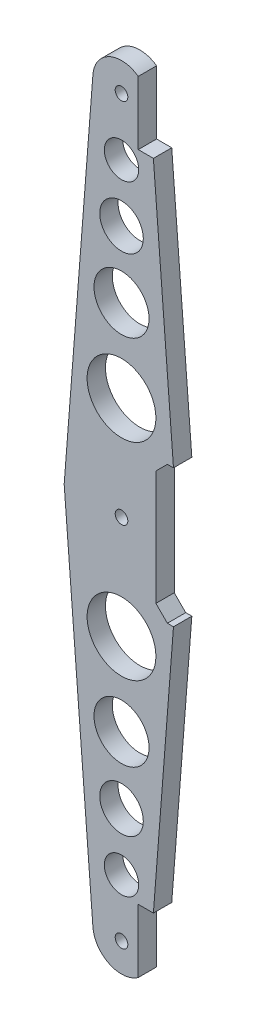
ISO-10303-21;
HEADER;
FILE_DESCRIPTION(('STEP AP214'),'2;1');
FILE_NAME('part.step','',(''),(''),'','','');
FILE_SCHEMA(('AUTOMOTIVE_DESIGN { 1 0 10303 214 1 1 1 1 }'));
ENDSEC;
DATA;
#1=APPLICATION_CONTEXT('core data for automotive mechanical design processes');
#2=APPLICATION_PROTOCOL_DEFINITION('international standard','automotive_design',2000,#1);
#3=PRODUCT_CONTEXT('',#1,'mechanical');
#4=PRODUCT('Part','Part','',(#3));
#5=PRODUCT_RELATED_PRODUCT_CATEGORY('part','',(#4));
#6=PRODUCT_DEFINITION_FORMATION('','',#4);
#7=PRODUCT_DEFINITION_CONTEXT('part definition',#1,'design');
#8=PRODUCT_DEFINITION('design','',#6,#7);
#9=PRODUCT_DEFINITION_SHAPE('','',#8);
#10=(LENGTH_UNIT() NAMED_UNIT(*) SI_UNIT(.MILLI.,.METRE.));
#11=(NAMED_UNIT(*) PLANE_ANGLE_UNIT() SI_UNIT($,.RADIAN.));
#12=(NAMED_UNIT(*) SI_UNIT($,.STERADIAN.) SOLID_ANGLE_UNIT());
#13=UNCERTAINTY_MEASURE_WITH_UNIT(LENGTH_MEASURE(1.E-05),#10,'distance_accuracy_value','');
#14=(GEOMETRIC_REPRESENTATION_CONTEXT(3) GLOBAL_UNCERTAINTY_ASSIGNED_CONTEXT((#13)) GLOBAL_UNIT_ASSIGNED_CONTEXT((#10,
#11,#12)) REPRESENTATION_CONTEXT('',''));
#15=CARTESIAN_POINT('',(0.,0.,0.));
#16=DIRECTION('',(0.,0.,1.));
#17=DIRECTION('',(1.,0.,0.));
#18=AXIS2_PLACEMENT_3D('',#15,#16,#17);
#19=CARTESIAN_POINT('',(0.,32.,1.6));
#20=DIRECTION('',(0.,0.,-1.));
#21=DIRECTION('',(-1.,0.,0.));
#22=AXIS2_PLACEMENT_3D('',#19,#20,#21);
#23=PLANE('',#22);
#24=CARTESIAN_POINT('',(0.,-32.,1.6));
#25=DIRECTION('',(0.,0.,-1.));
#26=DIRECTION('',(1.,0.,0.));
#27=AXIS2_PLACEMENT_3D('',#24,#25,#26);
#28=CIRCLE('',#27,0.550000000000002);
#29=CARTESIAN_POINT('',(0.550000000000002,-32.,1.6));
#30=VERTEX_POINT('',#29);
#31=EDGE_CURVE('E195',#30,#30,#28,.T.);
#32=ORIENTED_EDGE('',*,*,#31,.T.);
#33=EDGE_LOOP('',(#32));
#34=FACE_BOUND('',#33,.T.);
#35=CARTESIAN_POINT('',(0.,-22.,1.6));
#36=DIRECTION('',(0.,0.,-1.));
#37=DIRECTION('',(1.,0.,0.));
#38=AXIS2_PLACEMENT_3D('',#35,#36,#37);
#39=CIRCLE('',#38,1.9);
#40=CARTESIAN_POINT('',(1.9,-22.,1.6));
#41=VERTEX_POINT('',#40);
#42=EDGE_CURVE('E205',#41,#41,#39,.T.);
#43=ORIENTED_EDGE('',*,*,#42,.T.);
#44=EDGE_LOOP('',(#43));
#45=FACE_BOUND('',#44,.T.);
#46=CARTESIAN_POINT('',(0.,-9.00000000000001,1.6));
#47=DIRECTION('',(0.,0.,-1.));
#48=DIRECTION('',(1.,0.,0.));
#49=AXIS2_PLACEMENT_3D('',#46,#47,#48);
#50=CIRCLE('',#49,3.);
#51=CARTESIAN_POINT('',(3.,-9.00000000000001,1.6));
#52=VERTEX_POINT('',#51);
#53=EDGE_CURVE('E217',#52,#52,#50,.T.);
#54=ORIENTED_EDGE('',*,*,#53,.T.);
#55=EDGE_LOOP('',(#54));
#56=FACE_BOUND('',#55,.T.);
#57=CARTESIAN_POINT('',(0.,32.,1.6));
#58=DIRECTION('',(0.,0.,1.));
#59=DIRECTION('',(1.,0.,0.));
#60=AXIS2_PLACEMENT_3D('',#57,#58,#59);
#61=CIRCLE('',#60,0.550000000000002);
#62=CARTESIAN_POINT('',(0.550000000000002,32.,1.6));
#63=VERTEX_POINT('',#62);
#64=EDGE_CURVE('E241',#63,#63,#61,.T.);
#65=ORIENTED_EDGE('',*,*,#64,.F.);
#66=EDGE_LOOP('',(#65));
#67=FACE_BOUND('',#66,.T.);
#68=CARTESIAN_POINT('',(0.,27.,1.6));
#69=DIRECTION('',(0.,0.,1.));
#70=DIRECTION('',(1.,0.,0.));
#71=AXIS2_PLACEMENT_3D('',#68,#69,#70);
#72=CIRCLE('',#71,1.5);
#73=CARTESIAN_POINT('',(1.5,27.,1.6));
#74=VERTEX_POINT('',#73);
#75=EDGE_CURVE('E245',#74,#74,#72,.T.);
#76=ORIENTED_EDGE('',*,*,#75,.F.);
#77=EDGE_LOOP('',(#76));
#78=FACE_BOUND('',#77,.T.);
#79=CARTESIAN_POINT('',(0.,22.,1.6));
#80=DIRECTION('',(0.,0.,1.));
#81=DIRECTION('',(1.,0.,0.));
#82=AXIS2_PLACEMENT_3D('',#79,#80,#81);
#83=CIRCLE('',#82,1.9);
#84=CARTESIAN_POINT('',(1.9,22.,1.6));
#85=VERTEX_POINT('',#84);
#86=EDGE_CURVE('E251',#85,#85,#83,.T.);
#87=ORIENTED_EDGE('',*,*,#86,.F.);
#88=EDGE_LOOP('',(#87));
#89=FACE_BOUND('',#88,.T.);
#90=CARTESIAN_POINT('',(0.,16.2,1.6));
#91=DIRECTION('',(0.,0.,1.));
#92=DIRECTION('',(1.,0.,0.));
#93=AXIS2_PLACEMENT_3D('',#90,#91,#92);
#94=CIRCLE('',#93,2.4);
#95=CARTESIAN_POINT('',(2.4,16.2,1.6));
#96=VERTEX_POINT('',#95);
#97=EDGE_CURVE('E257',#96,#96,#94,.T.);
#98=ORIENTED_EDGE('',*,*,#97,.F.);
#99=EDGE_LOOP('',(#98));
#100=FACE_BOUND('',#99,.T.);
#101=CARTESIAN_POINT('',(0.,9.00000000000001,1.6));
#102=DIRECTION('',(0.,0.,1.));
#103=DIRECTION('',(1.,0.,0.));
#104=AXIS2_PLACEMENT_3D('',#101,#102,#103);
#105=CIRCLE('',#104,3.);
#106=CARTESIAN_POINT('',(3.,9.00000000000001,1.6));
#107=VERTEX_POINT('',#106);
#108=EDGE_CURVE('E263',#107,#107,#105,.T.);
#109=ORIENTED_EDGE('',*,*,#108,.F.);
#110=EDGE_LOOP('',(#109));
#111=FACE_BOUND('',#110,.T.);
#112=CARTESIAN_POINT('',(0.,0.,1.6));
#113=DIRECTION('',(0.,0.,1.));
#114=DIRECTION('',(1.,0.,0.));
#115=AXIS2_PLACEMENT_3D('',#112,#113,#114);
#116=CIRCLE('',#115,0.55);
#117=CARTESIAN_POINT('',(0.55,0.,1.6));
#118=VERTEX_POINT('',#117);
#119=EDGE_CURVE('E269',#118,#118,#116,.T.);
#120=ORIENTED_EDGE('',*,*,#119,.F.);
#121=EDGE_LOOP('',(#120));
#122=FACE_BOUND('',#121,.T.);
#123=CARTESIAN_POINT('',(0.,-16.2,1.6));
#124=DIRECTION('',(0.,0.,-1.));
#125=DIRECTION('',(1.,0.,0.));
#126=AXIS2_PLACEMENT_3D('',#123,#124,#125);
#127=CIRCLE('',#126,2.4);
#128=CARTESIAN_POINT('',(2.4,-16.2,1.6));
#129=VERTEX_POINT('',#128);
#130=EDGE_CURVE('E211',#129,#129,#127,.T.);
#131=ORIENTED_EDGE('',*,*,#130,.T.);
#132=EDGE_LOOP('',(#131));
#133=FACE_BOUND('',#132,.T.);
#134=CARTESIAN_POINT('',(0.,-27.,1.6));
#135=DIRECTION('',(0.,0.,-1.));
#136=DIRECTION('',(1.,0.,0.));
#137=AXIS2_PLACEMENT_3D('',#134,#135,#136);
#138=CIRCLE('',#137,1.5);
#139=CARTESIAN_POINT('',(1.5,-27.,1.6));
#140=VERTEX_POINT('',#139);
#141=EDGE_CURVE('E199',#140,#140,#138,.T.);
#142=ORIENTED_EDGE('',*,*,#141,.T.);
#143=EDGE_LOOP('',(#142));
#144=FACE_BOUND('',#143,.T.);
#145=DIRECTION('',(0.0776531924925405,0.996980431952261,0.));
#146=VECTOR('',#145,1.);
#147=CARTESIAN_POINT('',(2.49245107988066,-32.1941329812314,1.6));
#148=LINE('',#147,#146);
#149=CARTESIAN_POINT('',(2.78018111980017,-28.5,1.6));
#150=VERTEX_POINT('',#149);
#151=CARTESIAN_POINT('',(4.53266970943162,-6.,1.6));
#152=VERTEX_POINT('',#151);
#153=EDGE_CURVE('E278',#150,#152,#148,.T.);
#154=ORIENTED_EDGE('',*,*,#153,.T.);
#155=DIRECTION('',(1.,0.,0.));
#156=VECTOR('',#155,1.);
#157=CARTESIAN_POINT('',(9.99999999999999,-6.,1.6));
#158=LINE('',#157,#156);
#159=CARTESIAN_POINT('',(3.99999999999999,-6.,1.6));
#160=VERTEX_POINT('',#159);
#161=EDGE_CURVE('E162',#160,#152,#158,.T.);
#162=ORIENTED_EDGE('',*,*,#161,.F.);
#163=DIRECTION('',(0.707106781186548,-0.707106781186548,0.));
#164=VECTOR('',#163,1.);
#165=CARTESIAN_POINT('',(3.99999999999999,-6.,1.6));
#166=LINE('',#165,#164);
#167=CARTESIAN_POINT('',(2.99999999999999,-5.,1.6));
#168=VERTEX_POINT('',#167);
#169=EDGE_CURVE('E164',#168,#160,#166,.T.);
#170=ORIENTED_EDGE('',*,*,#169,.F.);
#171=DIRECTION('',(0.,-1.,0.));
#172=VECTOR('',#171,1.);
#173=CARTESIAN_POINT('',(2.99999999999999,5.,1.6));
#174=LINE('',#173,#172);
#175=CARTESIAN_POINT('',(2.99999999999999,5.,1.6));
#176=VERTEX_POINT('',#175);
#177=EDGE_CURVE('E175',#176,#168,#174,.T.);
#178=ORIENTED_EDGE('',*,*,#177,.F.);
#179=DIRECTION('',(-0.707106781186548,-0.707106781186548,0.));
#180=VECTOR('',#179,1.);
#181=CARTESIAN_POINT('',(3.99999999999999,6.,1.6));
#182=LINE('',#181,#180);
#183=CARTESIAN_POINT('',(3.99999999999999,6.,1.6));
#184=VERTEX_POINT('',#183);
#185=EDGE_CURVE('E173',#184,#176,#182,.T.);
#186=ORIENTED_EDGE('',*,*,#185,.F.);
#187=DIRECTION('',(-1.,0.,0.));
#188=VECTOR('',#187,1.);
#189=CARTESIAN_POINT('',(9.99999999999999,6.,1.6));
#190=LINE('',#189,#188);
#191=CARTESIAN_POINT('',(4.53266970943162,6.,1.6));
#192=VERTEX_POINT('',#191);
#193=EDGE_CURVE('E141',#192,#184,#190,.T.);
#194=ORIENTED_EDGE('',*,*,#193,.F.);
#195=DIRECTION('',(-0.0776531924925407,0.996980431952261,0.));
#196=VECTOR('',#195,1.);
#197=CARTESIAN_POINT('',(2.49245107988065,32.1941329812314,1.6));
#198=LINE('',#197,#196);
#199=CARTESIAN_POINT('',(2.78018111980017,28.5,1.6));
#200=VERTEX_POINT('',#199);
#201=EDGE_CURVE('E281',#192,#200,#198,.T.);
#202=ORIENTED_EDGE('',*,*,#201,.T.);
#203=DIRECTION('',(1.,0.,0.));
#204=VECTOR('',#203,1.);
#205=CARTESIAN_POINT('',(4.53962509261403,28.5,1.6));
#206=LINE('',#205,#204);
#207=CARTESIAN_POINT('',(1.46,28.5,1.6));
#208=VERTEX_POINT('',#207);
#209=EDGE_CURVE('E229',#208,#200,#206,.T.);
#210=ORIENTED_EDGE('',*,*,#209,.F.);
#211=DIRECTION('',(0.,-1.,0.));
#212=VECTOR('',#211,1.);
#213=CARTESIAN_POINT('',(1.46,34.5,1.6));
#214=LINE('',#213,#212);
#215=CARTESIAN_POINT('',(1.46,34.0293841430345,1.6));
#216=VERTEX_POINT('',#215);
#217=EDGE_CURVE('E223',#216,#208,#214,.T.);
#218=ORIENTED_EDGE('',*,*,#217,.F.);
#219=CARTESIAN_POINT('',(0.,32.,1.6));
#220=DIRECTION('',(0.,0.,1.));
#221=DIRECTION('',(-1.,0.,0.));
#222=AXIS2_PLACEMENT_3D('',#219,#220,#221);
#223=CIRCLE('',#222,2.5);
#224=CARTESIAN_POINT('',(-2.49245107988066,32.1941329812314,1.6));
#225=VERTEX_POINT('',#224);
#226=EDGE_CURVE('E284',#216,#225,#223,.T.);
#227=ORIENTED_EDGE('',*,*,#226,.T.);
#228=DIRECTION('',(-0.0776531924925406,-0.996980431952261,0.));
#229=VECTOR('',#228,1.);
#230=CARTESIAN_POINT('',(-5.,0.,1.6));
#231=LINE('',#230,#229);
#232=CARTESIAN_POINT('',(-5.,0.,1.6));
#233=VERTEX_POINT('',#232);
#234=EDGE_CURVE('E286',#225,#233,#231,.T.);
#235=ORIENTED_EDGE('',*,*,#234,.T.);
#236=DIRECTION('',(0.0776531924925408,-0.996980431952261,0.));
#237=VECTOR('',#236,1.);
#238=CARTESIAN_POINT('',(-5.,0.,1.6));
#239=LINE('',#238,#237);
#240=CARTESIAN_POINT('',(-2.49245107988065,-32.1941329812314,1.6));
#241=VERTEX_POINT('',#240);
#242=EDGE_CURVE('E288',#233,#241,#239,.T.);
#243=ORIENTED_EDGE('',*,*,#242,.T.);
#244=CARTESIAN_POINT('',(0.,-32.,1.6));
#245=DIRECTION('',(0.,0.,1.));
#246=DIRECTION('',(1.,0.,0.));
#247=AXIS2_PLACEMENT_3D('',#244,#245,#246);
#248=CIRCLE('',#247,2.5);
#249=CARTESIAN_POINT('',(1.46,-34.0293841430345,1.6));
#250=VERTEX_POINT('',#249);
#251=EDGE_CURVE('E290',#241,#250,#248,.T.);
#252=ORIENTED_EDGE('',*,*,#251,.T.);
#253=DIRECTION('',(0.,1.,0.));
#254=VECTOR('',#253,1.);
#255=CARTESIAN_POINT('',(1.46,-34.5,1.6));
#256=LINE('',#255,#254);
#257=CARTESIAN_POINT('',(1.46,-28.5,1.6));
#258=VERTEX_POINT('',#257);
#259=EDGE_CURVE('E55',#250,#258,#256,.T.);
#260=ORIENTED_EDGE('',*,*,#259,.T.);
#261=DIRECTION('',(1.,0.,0.));
#262=VECTOR('',#261,1.);
#263=CARTESIAN_POINT('',(4.53962509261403,-28.5,1.6));
#264=LINE('',#263,#262);
#265=EDGE_CURVE('E182',#258,#150,#264,.T.);
#266=ORIENTED_EDGE('',*,*,#265,.T.);
#267=EDGE_LOOP('',(#154,#162,#170,#178,#186,#194,#202,#210,#218,#227,#235,#243,#252,#260,#266));
#268=FACE_BOUND('',#267,.T.);
#269=ADVANCED_FACE('F32',(#34,#45,#56,#67,#78,#89,#100,#111,#122,#133,#144,#268),#23,.F.);
#270=CARTESIAN_POINT('',(0.,32.,0.));
#271=DIRECTION('',(0.,0.,-1.));
#272=DIRECTION('',(-1.,0.,0.));
#273=AXIS2_PLACEMENT_3D('',#270,#271,#272);
#274=PLANE('',#273);
#275=DIRECTION('',(1.,0.,0.));
#276=VECTOR('',#275,1.);
#277=CARTESIAN_POINT('',(9.99999999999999,-6.,0.));
#278=LINE('',#277,#276);
#279=CARTESIAN_POINT('',(3.99999999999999,-6.,0.));
#280=VERTEX_POINT('',#279);
#281=CARTESIAN_POINT('',(4.53266970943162,-6.,0.));
#282=VERTEX_POINT('',#281);
#283=EDGE_CURVE('E146',#280,#282,#278,.T.);
#284=ORIENTED_EDGE('',*,*,#283,.T.);
#285=DIRECTION('',(0.0776531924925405,0.996980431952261,0.));
#286=VECTOR('',#285,1.);
#287=CARTESIAN_POINT('',(2.49245107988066,-32.1941329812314,0.));
#288=LINE('',#287,#286);
#289=CARTESIAN_POINT('',(2.78018111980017,-28.5,0.));
#290=VERTEX_POINT('',#289);
#291=EDGE_CURVE('E275',#290,#282,#288,.T.);
#292=ORIENTED_EDGE('',*,*,#291,.F.);
#293=DIRECTION('',(1.,0.,0.));
#294=VECTOR('',#293,1.);
#295=CARTESIAN_POINT('',(4.53962509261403,-28.5,0.));
#296=LINE('',#295,#294);
#297=CARTESIAN_POINT('',(1.46,-28.5,0.));
#298=VERTEX_POINT('',#297);
#299=EDGE_CURVE('E186',#298,#290,#296,.T.);
#300=ORIENTED_EDGE('',*,*,#299,.F.);
#301=DIRECTION('',(0.,1.,0.));
#302=VECTOR('',#301,1.);
#303=CARTESIAN_POINT('',(1.46,-34.5,0.));
#304=LINE('',#303,#302);
#305=CARTESIAN_POINT('',(1.46,-34.0293841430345,0.));
#306=VERTEX_POINT('',#305);
#307=EDGE_CURVE('E188',#306,#298,#304,.T.);
#308=ORIENTED_EDGE('',*,*,#307,.F.);
#309=CARTESIAN_POINT('',(0.,-32.,0.));
#310=DIRECTION('',(0.,0.,1.));
#311=DIRECTION('',(1.,0.,0.));
#312=AXIS2_PLACEMENT_3D('',#309,#310,#311);
#313=CIRCLE('',#312,2.5);
#314=CARTESIAN_POINT('',(-2.49245107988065,-32.1941329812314,0.));
#315=VERTEX_POINT('',#314);
#316=EDGE_CURVE('E282',#315,#306,#313,.T.);
#317=ORIENTED_EDGE('',*,*,#316,.F.);
#318=DIRECTION('',(0.0776531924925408,-0.996980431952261,0.));
#319=VECTOR('',#318,1.);
#320=CARTESIAN_POINT('',(-5.,0.,0.));
#321=LINE('',#320,#319);
#322=CARTESIAN_POINT('',(-5.,0.,0.));
#323=VERTEX_POINT('',#322);
#324=EDGE_CURVE('E301',#323,#315,#321,.T.);
#325=ORIENTED_EDGE('',*,*,#324,.F.);
#326=DIRECTION('',(-0.0776531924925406,-0.996980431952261,0.));
#327=VECTOR('',#326,1.);
#328=CARTESIAN_POINT('',(-5.,0.,0.));
#329=LINE('',#328,#327);
#330=CARTESIAN_POINT('',(-2.49245107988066,32.1941329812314,0.));
#331=VERTEX_POINT('',#330);
#332=EDGE_CURVE('E299',#331,#323,#329,.T.);
#333=ORIENTED_EDGE('',*,*,#332,.F.);
#334=CARTESIAN_POINT('',(0.,32.,0.));
#335=DIRECTION('',(0.,0.,1.));
#336=DIRECTION('',(-1.,0.,0.));
#337=AXIS2_PLACEMENT_3D('',#334,#335,#336);
#338=CIRCLE('',#337,2.5);
#339=CARTESIAN_POINT('',(1.46,34.0293841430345,0.));
#340=VERTEX_POINT('',#339);
#341=EDGE_CURVE('E297',#340,#331,#338,.T.);
#342=ORIENTED_EDGE('',*,*,#341,.F.);
#343=DIRECTION('',(0.,1.,0.));
#344=VECTOR('',#343,1.);
#345=CARTESIAN_POINT('',(1.46,32.,0.));
#346=LINE('',#345,#344);
#347=CARTESIAN_POINT('',(1.46,28.5,0.));
#348=VERTEX_POINT('',#347);
#349=EDGE_CURVE('E313',#348,#340,#346,.T.);
#350=ORIENTED_EDGE('',*,*,#349,.F.);
#351=DIRECTION('',(1.,0.,0.));
#352=VECTOR('',#351,1.);
#353=CARTESIAN_POINT('',(4.53962509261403,28.5,0.));
#354=LINE('',#353,#352);
#355=CARTESIAN_POINT('',(2.78018111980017,28.5,0.));
#356=VERTEX_POINT('',#355);
#357=EDGE_CURVE('E226',#348,#356,#354,.T.);
#358=ORIENTED_EDGE('',*,*,#357,.T.);
#359=DIRECTION('',(-0.0776531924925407,0.996980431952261,0.));
#360=VECTOR('',#359,1.);
#361=CARTESIAN_POINT('',(2.49245107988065,32.1941329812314,0.));
#362=LINE('',#361,#360);
#363=CARTESIAN_POINT('',(4.53266970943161,6.00000000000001,0.));
#364=VERTEX_POINT('',#363);
#365=EDGE_CURVE('E161',#364,#356,#362,.T.);
#366=ORIENTED_EDGE('',*,*,#365,.F.);
#367=DIRECTION('',(-1.,0.,0.));
#368=VECTOR('',#367,1.);
#369=CARTESIAN_POINT('',(9.99999999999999,6.,0.));
#370=LINE('',#369,#368);
#371=CARTESIAN_POINT('',(3.99999999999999,6.,0.));
#372=VERTEX_POINT('',#371);
#373=EDGE_CURVE('E47',#364,#372,#370,.T.);
#374=ORIENTED_EDGE('',*,*,#373,.T.);
#375=DIRECTION('',(-0.707106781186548,-0.707106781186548,0.));
#376=VECTOR('',#375,1.);
#377=CARTESIAN_POINT('',(3.99999999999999,6.,0.));
#378=LINE('',#377,#376);
#379=CARTESIAN_POINT('',(2.99999999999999,5.,0.));
#380=VERTEX_POINT('',#379);
#381=EDGE_CURVE('E149',#372,#380,#378,.T.);
#382=ORIENTED_EDGE('',*,*,#381,.T.);
#383=DIRECTION('',(0.,-1.,0.));
#384=VECTOR('',#383,1.);
#385=CARTESIAN_POINT('',(2.99999999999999,5.,0.));
#386=LINE('',#385,#384);
#387=CARTESIAN_POINT('',(2.99999999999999,-5.,0.));
#388=VERTEX_POINT('',#387);
#389=EDGE_CURVE('E154',#380,#388,#386,.T.);
#390=ORIENTED_EDGE('',*,*,#389,.T.);
#391=DIRECTION('',(0.707106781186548,-0.707106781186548,0.));
#392=VECTOR('',#391,1.);
#393=CARTESIAN_POINT('',(3.99999999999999,-6.,0.));
#394=LINE('',#393,#392);
#395=EDGE_CURVE('E168',#388,#280,#394,.T.);
#396=ORIENTED_EDGE('',*,*,#395,.T.);
#397=EDGE_LOOP('',(#284,#292,#300,#308,#317,#325,#333,#342,#350,#358,#366,#374,#382,#390,#396));
#398=FACE_BOUND('',#397,.T.);
#399=CARTESIAN_POINT('',(0.,-32.,0.));
#400=DIRECTION('',(0.,0.,-1.));
#401=DIRECTION('',(1.,0.,0.));
#402=AXIS2_PLACEMENT_3D('',#399,#400,#401);
#403=CIRCLE('',#402,0.550000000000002);
#404=CARTESIAN_POINT('',(0.550000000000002,-32.,0.));
#405=VERTEX_POINT('',#404);
#406=EDGE_CURVE('E196',#405,#405,#403,.T.);
#407=ORIENTED_EDGE('',*,*,#406,.F.);
#408=EDGE_LOOP('',(#407));
#409=FACE_BOUND('',#408,.T.);
#410=CARTESIAN_POINT('',(0.,-22.,0.));
#411=DIRECTION('',(0.,0.,-1.));
#412=DIRECTION('',(1.,0.,0.));
#413=AXIS2_PLACEMENT_3D('',#410,#411,#412);
#414=CIRCLE('',#413,1.9);
#415=CARTESIAN_POINT('',(1.9,-22.,0.));
#416=VERTEX_POINT('',#415);
#417=EDGE_CURVE('E208',#416,#416,#414,.T.);
#418=ORIENTED_EDGE('',*,*,#417,.F.);
#419=EDGE_LOOP('',(#418));
#420=FACE_BOUND('',#419,.T.);
#421=CARTESIAN_POINT('',(0.,-9.00000000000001,0.));
#422=DIRECTION('',(0.,0.,-1.));
#423=DIRECTION('',(1.,0.,0.));
#424=AXIS2_PLACEMENT_3D('',#421,#422,#423);
#425=CIRCLE('',#424,3.);
#426=CARTESIAN_POINT('',(3.,-9.00000000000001,0.));
#427=VERTEX_POINT('',#426);
#428=EDGE_CURVE('E220',#427,#427,#425,.T.);
#429=ORIENTED_EDGE('',*,*,#428,.F.);
#430=EDGE_LOOP('',(#429));
#431=FACE_BOUND('',#430,.T.);
#432=CARTESIAN_POINT('',(0.,32.,0.));
#433=DIRECTION('',(0.,0.,1.));
#434=DIRECTION('',(1.,0.,0.));
#435=AXIS2_PLACEMENT_3D('',#432,#433,#434);
#436=CIRCLE('',#435,0.550000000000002);
#437=CARTESIAN_POINT('',(0.550000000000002,32.,0.));
#438=VERTEX_POINT('',#437);
#439=EDGE_CURVE('E242',#438,#438,#436,.T.);
#440=ORIENTED_EDGE('',*,*,#439,.T.);
#441=EDGE_LOOP('',(#440));
#442=FACE_BOUND('',#441,.T.);
#443=CARTESIAN_POINT('',(0.,27.,0.));
#444=DIRECTION('',(0.,0.,1.));
#445=DIRECTION('',(1.,0.,0.));
#446=AXIS2_PLACEMENT_3D('',#443,#444,#445);
#447=CIRCLE('',#446,1.5);
#448=CARTESIAN_POINT('',(1.5,27.,0.));
#449=VERTEX_POINT('',#448);
#450=EDGE_CURVE('E248',#449,#449,#447,.T.);
#451=ORIENTED_EDGE('',*,*,#450,.T.);
#452=EDGE_LOOP('',(#451));
#453=FACE_BOUND('',#452,.T.);
#454=CARTESIAN_POINT('',(0.,22.,0.));
#455=DIRECTION('',(0.,0.,1.));
#456=DIRECTION('',(1.,0.,0.));
#457=AXIS2_PLACEMENT_3D('',#454,#455,#456);
#458=CIRCLE('',#457,1.9);
#459=CARTESIAN_POINT('',(1.9,22.,0.));
#460=VERTEX_POINT('',#459);
#461=EDGE_CURVE('E254',#460,#460,#458,.T.);
#462=ORIENTED_EDGE('',*,*,#461,.T.);
#463=EDGE_LOOP('',(#462));
#464=FACE_BOUND('',#463,.T.);
#465=CARTESIAN_POINT('',(0.,16.2,0.));
#466=DIRECTION('',(0.,0.,1.));
#467=DIRECTION('',(1.,0.,0.));
#468=AXIS2_PLACEMENT_3D('',#465,#466,#467);
#469=CIRCLE('',#468,2.4);
#470=CARTESIAN_POINT('',(2.4,16.2,0.));
#471=VERTEX_POINT('',#470);
#472=EDGE_CURVE('E260',#471,#471,#469,.T.);
#473=ORIENTED_EDGE('',*,*,#472,.T.);
#474=EDGE_LOOP('',(#473));
#475=FACE_BOUND('',#474,.T.);
#476=CARTESIAN_POINT('',(0.,9.00000000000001,0.));
#477=DIRECTION('',(0.,0.,1.));
#478=DIRECTION('',(1.,0.,0.));
#479=AXIS2_PLACEMENT_3D('',#476,#477,#478);
#480=CIRCLE('',#479,3.);
#481=CARTESIAN_POINT('',(3.,9.00000000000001,0.));
#482=VERTEX_POINT('',#481);
#483=EDGE_CURVE('E266',#482,#482,#480,.T.);
#484=ORIENTED_EDGE('',*,*,#483,.T.);
#485=EDGE_LOOP('',(#484));
#486=FACE_BOUND('',#485,.T.);
#487=CARTESIAN_POINT('',(0.,0.,0.));
#488=DIRECTION('',(0.,0.,1.));
#489=DIRECTION('',(1.,0.,0.));
#490=AXIS2_PLACEMENT_3D('',#487,#488,#489);
#491=CIRCLE('',#490,0.55);
#492=CARTESIAN_POINT('',(0.55,0.,0.));
#493=VERTEX_POINT('',#492);
#494=EDGE_CURVE('E272',#493,#493,#491,.T.);
#495=ORIENTED_EDGE('',*,*,#494,.T.);
#496=EDGE_LOOP('',(#495));
#497=FACE_BOUND('',#496,.T.);
#498=CARTESIAN_POINT('',(0.,-16.2,0.));
#499=DIRECTION('',(0.,0.,-1.));
#500=DIRECTION('',(1.,0.,0.));
#501=AXIS2_PLACEMENT_3D('',#498,#499,#500);
#502=CIRCLE('',#501,2.4);
#503=CARTESIAN_POINT('',(2.4,-16.2,0.));
#504=VERTEX_POINT('',#503);
#505=EDGE_CURVE('E214',#504,#504,#502,.T.);
#506=ORIENTED_EDGE('',*,*,#505,.F.);
#507=EDGE_LOOP('',(#506));
#508=FACE_BOUND('',#507,.T.);
#509=CARTESIAN_POINT('',(0.,-27.,0.));
#510=DIRECTION('',(0.,0.,-1.));
#511=DIRECTION('',(1.,0.,0.));
#512=AXIS2_PLACEMENT_3D('',#509,#510,#511);
#513=CIRCLE('',#512,1.5);
#514=CARTESIAN_POINT('',(1.5,-27.,0.));
#515=VERTEX_POINT('',#514);
#516=EDGE_CURVE('E202',#515,#515,#513,.T.);
#517=ORIENTED_EDGE('',*,*,#516,.F.);
#518=EDGE_LOOP('',(#517));
#519=FACE_BOUND('',#518,.T.);
#520=ADVANCED_FACE('F158',(#398,#409,#420,#431,#442,#453,#464,#475,#486,#497,#508,#519),#274,.T.);
#521=CARTESIAN_POINT('',(2.49245107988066,-32.1941329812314,1.6));
#522=DIRECTION('',(-0.996980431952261,0.0776531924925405,0.));
#523=DIRECTION('',(-0.0776531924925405,-0.996980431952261,0.));
#524=AXIS2_PLACEMENT_3D('',#521,#522,#523);
#525=PLANE('',#524);
#526=ORIENTED_EDGE('',*,*,#291,.T.);
#527=DIRECTION('',(0.,0.,1.));
#528=VECTOR('',#527,1.);
#529=CARTESIAN_POINT('',(4.53266970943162,-6.,1.6));
#530=LINE('',#529,#528);
#531=EDGE_CURVE('E11',#282,#152,#530,.T.);
#532=ORIENTED_EDGE('',*,*,#531,.T.);
#533=ORIENTED_EDGE('',*,*,#153,.F.);
#534=DIRECTION('',(0.,0.,1.));
#535=VECTOR('',#534,1.);
#536=CARTESIAN_POINT('',(2.78018111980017,-28.5,1.6));
#537=LINE('',#536,#535);
#538=EDGE_CURVE('E317',#290,#150,#537,.T.);
#539=ORIENTED_EDGE('',*,*,#538,.F.);
#540=EDGE_LOOP('',(#526,#532,#533,#539));
#541=FACE_BOUND('',#540,.T.);
#542=ADVANCED_FACE('F34',(#541),#525,.F.);
#543=CARTESIAN_POINT('',(0.,-32.,1.6));
#544=DIRECTION('',(0.,0.,-1.));
#545=DIRECTION('',(-1.,0.,0.));
#546=AXIS2_PLACEMENT_3D('',#543,#544,#545);
#547=CYLINDRICAL_SURFACE('',#546,2.5);
#548=DIRECTION('',(0.,0.,-1.));
#549=VECTOR('',#548,1.);
#550=CARTESIAN_POINT('',(1.46,-34.0293841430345,1.6));
#551=LINE('',#550,#549);
#552=EDGE_CURVE('E315',#250,#306,#551,.T.);
#553=ORIENTED_EDGE('',*,*,#552,.F.);
#554=ORIENTED_EDGE('',*,*,#251,.F.);
#555=DIRECTION('',(0.,0.,-1.));
#556=VECTOR('',#555,1.);
#557=CARTESIAN_POINT('',(-2.49245107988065,-32.1941329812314,1.6));
#558=LINE('',#557,#556);
#559=EDGE_CURVE('E293',#241,#315,#558,.T.);
#560=ORIENTED_EDGE('',*,*,#559,.T.);
#561=ORIENTED_EDGE('',*,*,#316,.T.);
#562=EDGE_LOOP('',(#553,#554,#560,#561));
#563=FACE_BOUND('',#562,.T.);
#564=ADVANCED_FACE('F348',(#563),#547,.T.);
#565=CARTESIAN_POINT('',(2.49245107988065,32.1941329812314,1.6));
#566=DIRECTION('',(-0.996980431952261,-0.0776531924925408,0.));
#567=DIRECTION('',(0.0776531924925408,-0.996980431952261,0.));
#568=AXIS2_PLACEMENT_3D('',#565,#566,#567);
#569=PLANE('',#568);
#570=ORIENTED_EDGE('',*,*,#201,.F.);
#571=DIRECTION('',(0.,0.,-1.));
#572=VECTOR('',#571,1.);
#573=CARTESIAN_POINT('',(4.53266970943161,6.,1.6));
#574=LINE('',#573,#572);
#575=EDGE_CURVE('E40',#192,#364,#574,.T.);
#576=ORIENTED_EDGE('',*,*,#575,.T.);
#577=ORIENTED_EDGE('',*,*,#365,.T.);
#578=DIRECTION('',(0.,0.,1.));
#579=VECTOR('',#578,1.);
#580=CARTESIAN_POINT('',(2.78018111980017,28.5,1.6));
#581=LINE('',#580,#579);
#582=EDGE_CURVE('E238',#356,#200,#581,.T.);
#583=ORIENTED_EDGE('',*,*,#582,.T.);
#584=EDGE_LOOP('',(#570,#576,#577,#583));
#585=FACE_BOUND('',#584,.T.);
#586=ADVANCED_FACE('F320',(#585),#569,.F.);
#587=CARTESIAN_POINT('',(0.,32.,1.6));
#588=DIRECTION('',(0.,0.,-1.));
#589=DIRECTION('',(-1.,0.,0.));
#590=AXIS2_PLACEMENT_3D('',#587,#588,#589);
#591=CYLINDRICAL_SURFACE('',#590,2.5);
#592=ORIENTED_EDGE('',*,*,#226,.F.);
#593=DIRECTION('',(0.,0.,-1.));
#594=VECTOR('',#593,1.);
#595=CARTESIAN_POINT('',(1.46,34.0293841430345,1.6));
#596=LINE('',#595,#594);
#597=EDGE_CURVE('E235',#216,#340,#596,.T.);
#598=ORIENTED_EDGE('',*,*,#597,.T.);
#599=ORIENTED_EDGE('',*,*,#341,.T.);
#600=DIRECTION('',(0.,0.,-1.));
#601=VECTOR('',#600,1.);
#602=CARTESIAN_POINT('',(-2.49245107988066,32.1941329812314,1.6));
#603=LINE('',#602,#601);
#604=EDGE_CURVE('E310',#225,#331,#603,.T.);
#605=ORIENTED_EDGE('',*,*,#604,.F.);
#606=EDGE_LOOP('',(#592,#598,#599,#605));
#607=FACE_BOUND('',#606,.T.);
#608=ADVANCED_FACE('F364',(#607),#591,.T.);
#609=CARTESIAN_POINT('',(-5.,0.,1.6));
#610=DIRECTION('',(0.996980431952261,-0.0776531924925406,0.));
#611=DIRECTION('',(0.0776531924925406,0.996980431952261,0.));
#612=AXIS2_PLACEMENT_3D('',#609,#610,#611);
#613=PLANE('',#612);
#614=ORIENTED_EDGE('',*,*,#332,.T.);
#615=DIRECTION('',(0.,0.,-1.));
#616=VECTOR('',#615,1.);
#617=CARTESIAN_POINT('',(-5.,0.,1.6));
#618=LINE('',#617,#616);
#619=EDGE_CURVE('E307',#233,#323,#618,.T.);
#620=ORIENTED_EDGE('',*,*,#619,.F.);
#621=ORIENTED_EDGE('',*,*,#234,.F.);
#622=ORIENTED_EDGE('',*,*,#604,.T.);
#623=EDGE_LOOP('',(#614,#620,#621,#622));
#624=FACE_BOUND('',#623,.T.);
#625=ADVANCED_FACE('F359',(#624),#613,.F.);
#626=CARTESIAN_POINT('',(-5.,0.,1.6));
#627=DIRECTION('',(0.996980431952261,0.0776531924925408,0.));
#628=DIRECTION('',(-0.0776531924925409,0.996980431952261,0.));
#629=AXIS2_PLACEMENT_3D('',#626,#627,#628);
#630=PLANE('',#629);
#631=ORIENTED_EDGE('',*,*,#324,.T.);
#632=ORIENTED_EDGE('',*,*,#559,.F.);
#633=ORIENTED_EDGE('',*,*,#242,.F.);
#634=ORIENTED_EDGE('',*,*,#619,.T.);
#635=EDGE_LOOP('',(#631,#632,#633,#634));
#636=FACE_BOUND('',#635,.T.);
#637=ADVANCED_FACE('F353',(#636),#630,.F.);
#638=CARTESIAN_POINT('',(0.,0.,0.));
#639=DIRECTION('',(0.,0.,1.));
#640=DIRECTION('',(1.,0.,0.));
#641=AXIS2_PLACEMENT_3D('',#638,#639,#640);
#642=CYLINDRICAL_SURFACE('',#641,0.55);
#643=ORIENTED_EDGE('',*,*,#494,.F.);
#644=EDGE_LOOP('',(#643));
#645=FACE_BOUND('',#644,.T.);
#646=ORIENTED_EDGE('',*,*,#119,.T.);
#647=EDGE_LOOP('',(#646));
#648=FACE_BOUND('',#647,.T.);
#649=ADVANCED_FACE('F393',(#645,#648),#642,.F.);
#650=CARTESIAN_POINT('',(0.,9.00000000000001,0.));
#651=DIRECTION('',(0.,0.,1.));
#652=DIRECTION('',(1.,0.,0.));
#653=AXIS2_PLACEMENT_3D('',#650,#651,#652);
#654=CYLINDRICAL_SURFACE('',#653,3.);
#655=ORIENTED_EDGE('',*,*,#483,.F.);
#656=EDGE_LOOP('',(#655));
#657=FACE_BOUND('',#656,.T.);
#658=ORIENTED_EDGE('',*,*,#108,.T.);
#659=EDGE_LOOP('',(#658));
#660=FACE_BOUND('',#659,.T.);
#661=ADVANCED_FACE('F430',(#657,#660),#654,.F.);
#662=CARTESIAN_POINT('',(0.,16.2,0.));
#663=DIRECTION('',(0.,0.,1.));
#664=DIRECTION('',(1.,0.,0.));
#665=AXIS2_PLACEMENT_3D('',#662,#663,#664);
#666=CYLINDRICAL_SURFACE('',#665,2.4);
#667=ORIENTED_EDGE('',*,*,#472,.F.);
#668=EDGE_LOOP('',(#667));
#669=FACE_BOUND('',#668,.T.);
#670=ORIENTED_EDGE('',*,*,#97,.T.);
#671=EDGE_LOOP('',(#670));
#672=FACE_BOUND('',#671,.T.);
#673=ADVANCED_FACE('F437',(#669,#672),#666,.F.);
#674=CARTESIAN_POINT('',(0.,22.,0.));
#675=DIRECTION('',(0.,0.,1.));
#676=DIRECTION('',(1.,0.,0.));
#677=AXIS2_PLACEMENT_3D('',#674,#675,#676);
#678=CYLINDRICAL_SURFACE('',#677,1.9);
#679=ORIENTED_EDGE('',*,*,#461,.F.);
#680=EDGE_LOOP('',(#679));
#681=FACE_BOUND('',#680,.T.);
#682=ORIENTED_EDGE('',*,*,#86,.T.);
#683=EDGE_LOOP('',(#682));
#684=FACE_BOUND('',#683,.T.);
#685=ADVANCED_FACE('F444',(#681,#684),#678,.F.);
#686=CARTESIAN_POINT('',(0.,27.,0.));
#687=DIRECTION('',(0.,0.,1.));
#688=DIRECTION('',(1.,0.,0.));
#689=AXIS2_PLACEMENT_3D('',#686,#687,#688);
#690=CYLINDRICAL_SURFACE('',#689,1.5);
#691=ORIENTED_EDGE('',*,*,#450,.F.);
#692=EDGE_LOOP('',(#691));
#693=FACE_BOUND('',#692,.T.);
#694=ORIENTED_EDGE('',*,*,#75,.T.);
#695=EDGE_LOOP('',(#694));
#696=FACE_BOUND('',#695,.T.);
#697=ADVANCED_FACE('F380',(#693,#696),#690,.F.);
#698=CARTESIAN_POINT('',(0.,32.,0.));
#699=DIRECTION('',(0.,0.,1.));
#700=DIRECTION('',(1.,0.,0.));
#701=AXIS2_PLACEMENT_3D('',#698,#699,#700);
#702=CYLINDRICAL_SURFACE('',#701,0.550000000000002);
#703=ORIENTED_EDGE('',*,*,#439,.F.);
#704=EDGE_LOOP('',(#703));
#705=FACE_BOUND('',#704,.T.);
#706=ORIENTED_EDGE('',*,*,#64,.T.);
#707=EDGE_LOOP('',(#706));
#708=FACE_BOUND('',#707,.T.);
#709=ADVANCED_FACE('F372',(#705,#708),#702,.F.);
#710=CARTESIAN_POINT('',(4.53962509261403,28.5,0.));
#711=DIRECTION('',(0.,-1.,0.));
#712=DIRECTION('',(0.,0.,-1.));
#713=AXIS2_PLACEMENT_3D('',#710,#711,#712);
#714=PLANE('',#713);
#715=ORIENTED_EDGE('',*,*,#357,.F.);
#716=DIRECTION('',(0.,0.,1.));
#717=VECTOR('',#716,1.);
#718=CARTESIAN_POINT('',(1.46,28.5,0.));
#719=LINE('',#718,#717);
#720=EDGE_CURVE('E228',#348,#208,#719,.T.);
#721=ORIENTED_EDGE('',*,*,#720,.T.);
#722=ORIENTED_EDGE('',*,*,#209,.T.);
#723=ORIENTED_EDGE('',*,*,#582,.F.);
#724=EDGE_LOOP('',(#715,#721,#722,#723));
#725=FACE_BOUND('',#724,.T.);
#726=ADVANCED_FACE('F370',(#725),#714,.F.);
#727=CARTESIAN_POINT('',(1.46,34.5,0.));
#728=DIRECTION('',(-1.,0.,0.));
#729=DIRECTION('',(0.,-1.,0.));
#730=AXIS2_PLACEMENT_3D('',#727,#728,#729);
#731=PLANE('',#730);
#732=ORIENTED_EDGE('',*,*,#217,.T.);
#733=ORIENTED_EDGE('',*,*,#720,.F.);
#734=ORIENTED_EDGE('',*,*,#349,.T.);
#735=ORIENTED_EDGE('',*,*,#597,.F.);
#736=EDGE_LOOP('',(#732,#733,#734,#735));
#737=FACE_BOUND('',#736,.T.);
#738=ADVANCED_FACE('F367',(#737),#731,.F.);
#739=CARTESIAN_POINT('',(0.,-9.00000000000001,0.));
#740=DIRECTION('',(0.,0.,1.));
#741=DIRECTION('',(1.,0.,0.));
#742=AXIS2_PLACEMENT_3D('',#739,#740,#741);
#743=CYLINDRICAL_SURFACE('',#742,3.);
#744=ORIENTED_EDGE('',*,*,#428,.T.);
#745=EDGE_LOOP('',(#744));
#746=FACE_BOUND('',#745,.T.);
#747=ORIENTED_EDGE('',*,*,#53,.F.);
#748=EDGE_LOOP('',(#747));
#749=FACE_BOUND('',#748,.T.);
#750=ADVANCED_FACE('F378',(#746,#749),#743,.F.);
#751=CARTESIAN_POINT('',(0.,-16.2,0.));
#752=DIRECTION('',(0.,0.,1.));
#753=DIRECTION('',(1.,0.,0.));
#754=AXIS2_PLACEMENT_3D('',#751,#752,#753);
#755=CYLINDRICAL_SURFACE('',#754,2.4);
#756=ORIENTED_EDGE('',*,*,#505,.T.);
#757=EDGE_LOOP('',(#756));
#758=FACE_BOUND('',#757,.T.);
#759=ORIENTED_EDGE('',*,*,#130,.F.);
#760=EDGE_LOOP('',(#759));
#761=FACE_BOUND('',#760,.T.);
#762=ADVANCED_FACE('F484',(#758,#761),#755,.F.);
#763=CARTESIAN_POINT('',(0.,-22.,0.));
#764=DIRECTION('',(0.,0.,1.));
#765=DIRECTION('',(1.,0.,0.));
#766=AXIS2_PLACEMENT_3D('',#763,#764,#765);
#767=CYLINDRICAL_SURFACE('',#766,1.9);
#768=ORIENTED_EDGE('',*,*,#417,.T.);
#769=EDGE_LOOP('',(#768));
#770=FACE_BOUND('',#769,.T.);
#771=ORIENTED_EDGE('',*,*,#42,.F.);
#772=EDGE_LOOP('',(#771));
#773=FACE_BOUND('',#772,.T.);
#774=ADVANCED_FACE('F492',(#770,#773),#767,.F.);
#775=CARTESIAN_POINT('',(0.,-27.,0.));
#776=DIRECTION('',(0.,0.,1.));
#777=DIRECTION('',(1.,0.,0.));
#778=AXIS2_PLACEMENT_3D('',#775,#776,#777);
#779=CYLINDRICAL_SURFACE('',#778,1.5);
#780=ORIENTED_EDGE('',*,*,#516,.T.);
#781=EDGE_LOOP('',(#780));
#782=FACE_BOUND('',#781,.T.);
#783=ORIENTED_EDGE('',*,*,#141,.F.);
#784=EDGE_LOOP('',(#783));
#785=FACE_BOUND('',#784,.T.);
#786=ADVANCED_FACE('F501',(#782,#785),#779,.F.);
#787=CARTESIAN_POINT('',(0.,-32.,0.));
#788=DIRECTION('',(0.,0.,1.));
#789=DIRECTION('',(1.,0.,0.));
#790=AXIS2_PLACEMENT_3D('',#787,#788,#789);
#791=CYLINDRICAL_SURFACE('',#790,0.550000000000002);
#792=ORIENTED_EDGE('',*,*,#406,.T.);
#793=EDGE_LOOP('',(#792));
#794=FACE_BOUND('',#793,.T.);
#795=ORIENTED_EDGE('',*,*,#31,.F.);
#796=EDGE_LOOP('',(#795));
#797=FACE_BOUND('',#796,.T.);
#798=ADVANCED_FACE('F510',(#794,#797),#791,.F.);
#799=CARTESIAN_POINT('',(4.53962509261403,-28.5,0.));
#800=DIRECTION('',(0.,-1.,0.));
#801=DIRECTION('',(0.,0.,-1.));
#802=AXIS2_PLACEMENT_3D('',#799,#800,#801);
#803=PLANE('',#802);
#804=ORIENTED_EDGE('',*,*,#538,.T.);
#805=ORIENTED_EDGE('',*,*,#265,.F.);
#806=DIRECTION('',(0.,0.,1.));
#807=VECTOR('',#806,1.);
#808=CARTESIAN_POINT('',(1.46,-28.5,0.));
#809=LINE('',#808,#807);
#810=EDGE_CURVE('E190',#298,#258,#809,.T.);
#811=ORIENTED_EDGE('',*,*,#810,.F.);
#812=ORIENTED_EDGE('',*,*,#299,.T.);
#813=EDGE_LOOP('',(#804,#805,#811,#812));
#814=FACE_BOUND('',#813,.T.);
#815=ADVANCED_FACE('F342',(#814),#803,.T.);
#816=CARTESIAN_POINT('',(1.46,-34.5,0.));
#817=DIRECTION('',(1.,0.,0.));
#818=DIRECTION('',(0.,1.,0.));
#819=AXIS2_PLACEMENT_3D('',#816,#817,#818);
#820=PLANE('',#819);
#821=ORIENTED_EDGE('',*,*,#552,.T.);
#822=ORIENTED_EDGE('',*,*,#307,.T.);
#823=ORIENTED_EDGE('',*,*,#810,.T.);
#824=ORIENTED_EDGE('',*,*,#259,.F.);
#825=EDGE_LOOP('',(#821,#822,#823,#824));
#826=FACE_BOUND('',#825,.T.);
#827=ADVANCED_FACE('F545',(#826),#820,.T.);
#828=CARTESIAN_POINT('',(9.99999999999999,-6.,0.));
#829=DIRECTION('',(0.,-1.,0.));
#830=DIRECTION('',(1.,0.,0.));
#831=AXIS2_PLACEMENT_3D('',#828,#829,#830);
#832=PLANE('',#831);
#833=ORIENTED_EDGE('',*,*,#283,.F.);
#834=DIRECTION('',(0.,0.,1.));
#835=VECTOR('',#834,1.);
#836=CARTESIAN_POINT('',(3.99999999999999,-6.,0.));
#837=LINE('',#836,#835);
#838=EDGE_CURVE('E180',#280,#160,#837,.T.);
#839=ORIENTED_EDGE('',*,*,#838,.T.);
#840=ORIENTED_EDGE('',*,*,#161,.T.);
#841=ORIENTED_EDGE('',*,*,#531,.F.);
#842=EDGE_LOOP('',(#833,#839,#840,#841));
#843=FACE_BOUND('',#842,.T.);
#844=ADVANCED_FACE('F335',(#843),#832,.F.);
#845=CARTESIAN_POINT('',(9.99999999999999,6.,0.));
#846=DIRECTION('',(0.,1.,0.));
#847=DIRECTION('',(-1.,0.,0.));
#848=AXIS2_PLACEMENT_3D('',#845,#846,#847);
#849=PLANE('',#848);
#850=ORIENTED_EDGE('',*,*,#193,.T.);
#851=DIRECTION('',(0.,0.,1.));
#852=VECTOR('',#851,1.);
#853=CARTESIAN_POINT('',(3.99999999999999,6.,0.));
#854=LINE('',#853,#852);
#855=EDGE_CURVE('E137',#372,#184,#854,.T.);
#856=ORIENTED_EDGE('',*,*,#855,.F.);
#857=ORIENTED_EDGE('',*,*,#373,.F.);
#858=ORIENTED_EDGE('',*,*,#575,.F.);
#859=EDGE_LOOP('',(#850,#856,#857,#858));
#860=FACE_BOUND('',#859,.T.);
#861=ADVANCED_FACE('F139',(#860),#849,.F.);
#862=CARTESIAN_POINT('',(3.99999999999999,-6.,0.));
#863=DIRECTION('',(-0.707106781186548,-0.707106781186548,0.));
#864=DIRECTION('',(0.707106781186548,-0.707106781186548,0.));
#865=AXIS2_PLACEMENT_3D('',#862,#863,#864);
#866=PLANE('',#865);
#867=ORIENTED_EDGE('',*,*,#169,.T.);
#868=ORIENTED_EDGE('',*,*,#838,.F.);
#869=ORIENTED_EDGE('',*,*,#395,.F.);
#870=DIRECTION('',(0.,0.,1.));
#871=VECTOR('',#870,1.);
#872=CARTESIAN_POINT('',(2.99999999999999,-5.,0.));
#873=LINE('',#872,#871);
#874=EDGE_CURVE('E183',#388,#168,#873,.T.);
#875=ORIENTED_EDGE('',*,*,#874,.T.);
#876=EDGE_LOOP('',(#867,#868,#869,#875));
#877=FACE_BOUND('',#876,.T.);
#878=ADVANCED_FACE('F333',(#877),#866,.F.);
#879=CARTESIAN_POINT('',(2.99999999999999,5.,0.));
#880=DIRECTION('',(-1.,0.,0.));
#881=DIRECTION('',(0.,0.,1.));
#882=AXIS2_PLACEMENT_3D('',#879,#880,#881);
#883=PLANE('',#882);
#884=ORIENTED_EDGE('',*,*,#177,.T.);
#885=ORIENTED_EDGE('',*,*,#874,.F.);
#886=ORIENTED_EDGE('',*,*,#389,.F.);
#887=DIRECTION('',(0.,0.,1.));
#888=VECTOR('',#887,1.);
#889=CARTESIAN_POINT('',(2.99999999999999,5.,0.));
#890=LINE('',#889,#888);
#891=EDGE_CURVE('E145',#380,#176,#890,.T.);
#892=ORIENTED_EDGE('',*,*,#891,.T.);
#893=EDGE_LOOP('',(#884,#885,#886,#892));
#894=FACE_BOUND('',#893,.T.);
#895=ADVANCED_FACE('F328',(#894),#883,.F.);
#896=CARTESIAN_POINT('',(3.99999999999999,6.,0.));
#897=DIRECTION('',(-0.707106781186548,0.707106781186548,0.));
#898=DIRECTION('',(-0.707106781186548,-0.707106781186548,0.));
#899=AXIS2_PLACEMENT_3D('',#896,#897,#898);
#900=PLANE('',#899);
#901=ORIENTED_EDGE('',*,*,#185,.T.);
#902=ORIENTED_EDGE('',*,*,#891,.F.);
#903=ORIENTED_EDGE('',*,*,#381,.F.);
#904=ORIENTED_EDGE('',*,*,#855,.T.);
#905=EDGE_LOOP('',(#901,#902,#903,#904));
#906=FACE_BOUND('',#905,.T.);
#907=ADVANCED_FACE('F150',(#906),#900,.F.);
#908=CLOSED_SHELL('',(#269,#520,#542,#564,#586,#608,#625,#637,#649,#661,#673,#685,#697,#709,
#726,#738,#750,#762,#774,#786,#798,#815,#827,#844,#861,#878,#895,#907));
#909=MANIFOLD_SOLID_BREP('B2',#908);
#910=ADVANCED_BREP_SHAPE_REPRESENTATION('',(#18,#909),#14);
#911=SHAPE_DEFINITION_REPRESENTATION(#9,#910);
ENDSEC;
END-ISO-10303-21;
